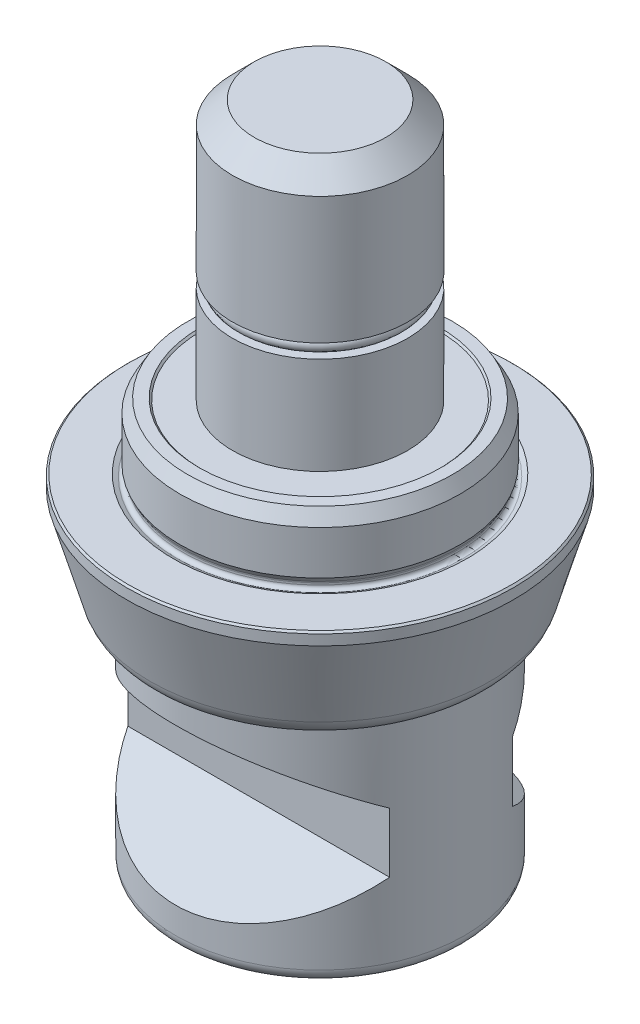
ISO-10303-21;
HEADER;
FILE_DESCRIPTION(('STEP AP214'),'2;1');
FILE_NAME('part.step','',(''),(''),'','','');
FILE_SCHEMA(('AUTOMOTIVE_DESIGN { 1 0 10303 214 1 1 1 1 }'));
ENDSEC;
DATA;
#1=APPLICATION_CONTEXT('core data for automotive mechanical design processes');
#2=APPLICATION_PROTOCOL_DEFINITION('international standard','automotive_design',2000,#1);
#3=PRODUCT_CONTEXT('',#1,'mechanical');
#4=PRODUCT('Part','Part','',(#3));
#5=PRODUCT_RELATED_PRODUCT_CATEGORY('part','',(#4));
#6=PRODUCT_DEFINITION_FORMATION('','',#4);
#7=PRODUCT_DEFINITION_CONTEXT('part definition',#1,'design');
#8=PRODUCT_DEFINITION('design','',#6,#7);
#9=PRODUCT_DEFINITION_SHAPE('','',#8);
#10=(LENGTH_UNIT() NAMED_UNIT(*) SI_UNIT(.MILLI.,.METRE.));
#11=(NAMED_UNIT(*) PLANE_ANGLE_UNIT() SI_UNIT($,.RADIAN.));
#12=(NAMED_UNIT(*) SI_UNIT($,.STERADIAN.) SOLID_ANGLE_UNIT());
#13=UNCERTAINTY_MEASURE_WITH_UNIT(LENGTH_MEASURE(1.E-05),#10,'distance_accuracy_value','');
#14=(GEOMETRIC_REPRESENTATION_CONTEXT(3) GLOBAL_UNCERTAINTY_ASSIGNED_CONTEXT((#13)) GLOBAL_UNIT_ASSIGNED_CONTEXT((#10,
#11,#12)) REPRESENTATION_CONTEXT('',''));
#15=CARTESIAN_POINT('',(0.,0.,0.));
#16=DIRECTION('',(0.,0.,1.));
#17=DIRECTION('',(1.,0.,0.));
#18=AXIS2_PLACEMENT_3D('',#15,#16,#17);
#19=CARTESIAN_POINT('',(0.,0.,0.));
#20=DIRECTION('',(0.,-1.,0.));
#21=DIRECTION('',(0.,0.,-1.));
#22=AXIS2_PLACEMENT_3D('',#19,#20,#21);
#23=CYLINDRICAL_SURFACE('',#22,16.);
#24=CARTESIAN_POINT('',(0.,1.,0.));
#25=DIRECTION('',(0.,-1.,0.));
#26=DIRECTION('',(0.,0.,-1.));
#27=AXIS2_PLACEMENT_3D('',#24,#25,#26);
#28=CIRCLE('',#27,16.);
#29=CARTESIAN_POINT('',(0.,1.,-16.));
#30=VERTEX_POINT('',#29);
#31=EDGE_CURVE('E378',#30,#30,#28,.T.);
#32=ORIENTED_EDGE('',*,*,#31,.F.);
#33=EDGE_LOOP('',(#32));
#34=FACE_BOUND('',#33,.T.);
#35=CARTESIAN_POINT('',(0.,6.,0.));
#36=DIRECTION('',(0.,1.,0.));
#37=DIRECTION('',(0.,0.,1.));
#38=AXIS2_PLACEMENT_3D('',#35,#36,#37);
#39=CIRCLE('',#38,16.);
#40=CARTESIAN_POINT('',(0.,6.,16.));
#41=VERTEX_POINT('',#40);
#42=EDGE_CURVE('E304',#41,#41,#39,.F.);
#43=ORIENTED_EDGE('',*,*,#42,.T.);
#44=EDGE_LOOP('',(#43));
#45=FACE_BOUND('',#44,.T.);
#46=ADVANCED_FACE('F16',(#34,#45),#23,.T.);
#47=CARTESIAN_POINT('',(16.,0.,0.));
#48=DIRECTION('',(0.,1.,0.));
#49=DIRECTION('',(0.,0.,1.));
#50=AXIS2_PLACEMENT_3D('',#47,#48,#49);
#51=PLANE('',#50);
#52=CARTESIAN_POINT('',(0.,0.,0.));
#53=DIRECTION('',(0.,-1.,0.));
#54=DIRECTION('',(0.,0.,-1.));
#55=AXIS2_PLACEMENT_3D('',#52,#53,#54);
#56=CIRCLE('',#55,16.774174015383);
#57=CARTESIAN_POINT('',(0.,0.,-16.774174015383));
#58=VERTEX_POINT('',#57);
#59=EDGE_CURVE('E375',#58,#58,#56,.T.);
#60=ORIENTED_EDGE('',*,*,#59,.T.);
#61=EDGE_LOOP('',(#60));
#62=FACE_BOUND('',#61,.T.);
#63=CARTESIAN_POINT('',(0.,0.,0.));
#64=DIRECTION('',(0.,1.,0.));
#65=DIRECTION('',(0.,0.,1.));
#66=AXIS2_PLACEMENT_3D('',#63,#64,#65);
#67=CIRCLE('',#66,21.9);
#68=CARTESIAN_POINT('',(0.,0.,21.9));
#69=VERTEX_POINT('',#68);
#70=EDGE_CURVE('E294',#69,#69,#67,.T.);
#71=ORIENTED_EDGE('',*,*,#70,.T.);
#72=EDGE_LOOP('',(#71));
#73=FACE_BOUND('',#72,.T.);
#74=ADVANCED_FACE('F257',(#62,#73),#51,.T.);
#75=CARTESIAN_POINT('',(0.,0.,0.));
#76=DIRECTION('',(0.,-1.,0.));
#77=DIRECTION('',(0.,0.,-1.));
#78=AXIS2_PLACEMENT_3D('',#75,#76,#77);
#79=CYLINDRICAL_SURFACE('',#78,22.1);
#80=CARTESIAN_POINT('',(0.,-0.199999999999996,0.));
#81=DIRECTION('',(0.,1.,0.));
#82=DIRECTION('',(0.,0.,1.));
#83=AXIS2_PLACEMENT_3D('',#80,#81,#82);
#84=CIRCLE('',#83,22.1);
#85=CARTESIAN_POINT('',(0.,-0.199999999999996,22.1));
#86=VERTEX_POINT('',#85);
#87=EDGE_CURVE('E297',#86,#86,#84,.F.);
#88=ORIENTED_EDGE('',*,*,#87,.T.);
#89=EDGE_LOOP('',(#88));
#90=FACE_BOUND('',#89,.T.);
#91=CARTESIAN_POINT('',(0.,-1.3949657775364,0.));
#92=DIRECTION('',(0.,-1.,0.));
#93=DIRECTION('',(0.,0.,-1.));
#94=AXIS2_PLACEMENT_3D('',#91,#92,#93);
#95=CIRCLE('',#94,22.1);
#96=CARTESIAN_POINT('',(0.,-1.3949657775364,-22.1));
#97=VERTEX_POINT('',#96);
#98=EDGE_CURVE('E369',#97,#97,#95,.T.);
#99=ORIENTED_EDGE('',*,*,#98,.F.);
#100=EDGE_LOOP('',(#99));
#101=FACE_BOUND('',#100,.T.);
#102=ADVANCED_FACE('F265',(#90,#101),#79,.T.);
#103=CARTESIAN_POINT('',(0.,-13.,0.));
#104=DIRECTION('',(0.,1.,0.));
#105=DIRECTION('',(0.,0.,1.));
#106=AXIS2_PLACEMENT_3D('',#103,#104,#105);
#107=CONICAL_SURFACE('',#106,18.7723099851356,0.279252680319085);
#108=CARTESIAN_POINT('',(0.,-10.826912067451,0.));
#109=DIRECTION('',(0.,-1.,0.));
#110=DIRECTION('',(0.,0.,-1.));
#111=AXIS2_PLACEMENT_3D('',#108,#109,#110);
#112=CIRCLE('',#111,19.3954329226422);
#113=CARTESIAN_POINT('',(0.,-10.826912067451,-19.3954329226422));
#114=VERTEX_POINT('',#113);
#115=EDGE_CURVE('E362',#114,#114,#112,.F.);
#116=ORIENTED_EDGE('',*,*,#115,.T.);
#117=EDGE_LOOP('',(#116));
#118=FACE_BOUND('',#117,.T.);
#119=ORIENTED_EDGE('',*,*,#98,.T.);
#120=EDGE_LOOP('',(#119));
#121=FACE_BOUND('',#120,.T.);
#122=ADVANCED_FACE('F409',(#118,#121),#107,.T.);
#123=CARTESIAN_POINT('',(10.,-13.,0.));
#124=DIRECTION('',(0.,-1.,0.));
#125=DIRECTION('',(0.,0.,-1.));
#126=AXIS2_PLACEMENT_3D('',#123,#124,#125);
#127=PLANE('',#126);
#128=CARTESIAN_POINT('',(0.,-13.,0.));
#129=DIRECTION('',(0.,-1.,0.));
#130=DIRECTION('',(0.,0.,-1.));
#131=AXIS2_PLACEMENT_3D('',#128,#129,#130);
#132=CIRCLE('',#131,16.);
#133=CARTESIAN_POINT('',(0.,-13.,-16.));
#134=VERTEX_POINT('',#133);
#135=EDGE_CURVE('E313',#134,#134,#132,.T.);
#136=ORIENTED_EDGE('',*,*,#135,.F.);
#137=EDGE_LOOP('',(#136));
#138=FACE_BOUND('',#137,.T.);
#139=CARTESIAN_POINT('',(0.,-13.,0.));
#140=DIRECTION('',(0.,-1.,0.));
#141=DIRECTION('',(0.,0.,-1.));
#142=AXIS2_PLACEMENT_3D('',#139,#140,#141);
#143=CIRCLE('',#142,16.5116478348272);
#144=CARTESIAN_POINT('',(0.,-13.,-16.5116478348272));
#145=VERTEX_POINT('',#144);
#146=EDGE_CURVE('E364',#145,#145,#143,.T.);
#147=ORIENTED_EDGE('',*,*,#146,.T.);
#148=EDGE_LOOP('',(#147));
#149=FACE_BOUND('',#148,.T.);
#150=ADVANCED_FACE('F356',(#138,#149),#127,.T.);
#151=CARTESIAN_POINT('',(10.,7.5,0.));
#152=DIRECTION('',(0.,1.,0.));
#153=DIRECTION('',(0.,0.,1.));
#154=AXIS2_PLACEMENT_3D('',#151,#152,#153);
#155=PLANE('',#154);
#156=CARTESIAN_POINT('',(0.,7.5,0.));
#157=DIRECTION('',(0.,1.,0.));
#158=DIRECTION('',(0.,0.,1.));
#159=AXIS2_PLACEMENT_3D('',#156,#157,#158);
#160=CIRCLE('',#159,13.8);
#161=CARTESIAN_POINT('',(0.,7.5,13.8));
#162=VERTEX_POINT('',#161);
#163=EDGE_CURVE('E310',#162,#162,#160,.F.);
#164=ORIENTED_EDGE('',*,*,#163,.T.);
#165=EDGE_LOOP('',(#164));
#166=FACE_BOUND('',#165,.T.);
#167=CARTESIAN_POINT('',(0.,7.5,0.));
#168=DIRECTION('',(0.,1.,0.));
#169=DIRECTION('',(0.,0.,1.));
#170=AXIS2_PLACEMENT_3D('',#167,#168,#169);
#171=CIRCLE('',#170,15.1339745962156);
#172=CARTESIAN_POINT('',(0.,7.5,15.1339745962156));
#173=VERTEX_POINT('',#172);
#174=EDGE_CURVE('E299',#173,#173,#171,.T.);
#175=ORIENTED_EDGE('',*,*,#174,.T.);
#176=EDGE_LOOP('',(#175));
#177=FACE_BOUND('',#176,.T.);
#178=ADVANCED_FACE('F276',(#166,#177),#155,.T.);
#179=CARTESIAN_POINT('',(0.,-10.,0.));
#180=DIRECTION('',(0.,-1.,0.));
#181=DIRECTION('',(0.,0.,-1.));
#182=AXIS2_PLACEMENT_3D('',#179,#180,#181);
#183=TOROIDAL_SURFACE('',#182,16.5116478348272,3.);
#184=ORIENTED_EDGE('',*,*,#115,.F.);
#185=EDGE_LOOP('',(#184));
#186=FACE_BOUND('',#185,.T.);
#187=ORIENTED_EDGE('',*,*,#146,.F.);
#188=EDGE_LOOP('',(#187));
#189=FACE_BOUND('',#188,.T.);
#190=ADVANCED_FACE('F272',(#186,#189),#183,.T.);
#191=CARTESIAN_POINT('',(0.,6.,0.));
#192=DIRECTION('',(0.,-1.,0.));
#193=DIRECTION('',(0.,0.,-1.));
#194=AXIS2_PLACEMENT_3D('',#191,#192,#193);
#195=CONICAL_SURFACE('',#194,16.,0.523598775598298);
#196=ORIENTED_EDGE('',*,*,#174,.F.);
#197=EDGE_LOOP('',(#196));
#198=FACE_BOUND('',#197,.T.);
#199=ORIENTED_EDGE('',*,*,#42,.F.);
#200=EDGE_LOOP('',(#199));
#201=FACE_BOUND('',#200,.T.);
#202=ADVANCED_FACE('F275',(#198,#201),#195,.T.);
#203=CARTESIAN_POINT('',(0.,-0.199999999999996,0.));
#204=DIRECTION('',(0.,-1.,0.));
#205=DIRECTION('',(0.,0.,-1.));
#206=AXIS2_PLACEMENT_3D('',#203,#204,#205);
#207=CONICAL_SURFACE('',#206,22.1,0.785398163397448);
#208=ORIENTED_EDGE('',*,*,#70,.F.);
#209=EDGE_LOOP('',(#208));
#210=FACE_BOUND('',#209,.T.);
#211=ORIENTED_EDGE('',*,*,#87,.F.);
#212=EDGE_LOOP('',(#211));
#213=FACE_BOUND('',#212,.T.);
#214=ADVANCED_FACE('F279',(#210,#213),#207,.T.);
#215=CARTESIAN_POINT('',(0.,0.1,0.));
#216=DIRECTION('',(0.,-1.,0.));
#217=DIRECTION('',(0.,0.,-1.));
#218=AXIS2_PLACEMENT_3D('',#215,#216,#217);
#219=TOROIDAL_SURFACE('',#218,16.1,0.4);
#220=CARTESIAN_POINT('',(0.,-0.254804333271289,0.));
#221=DIRECTION('',(0.,-1.,0.));
#222=DIRECTION('',(0.,0.,-1.));
#223=AXIS2_PLACEMENT_3D('',#220,#221,#222);
#224=CIRCLE('',#223,16.284699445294);
#225=CARTESIAN_POINT('',(0.,-0.254804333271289,-16.284699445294));
#226=VERTEX_POINT('',#225);
#227=EDGE_CURVE('E372',#226,#226,#224,.T.);
#228=ORIENTED_EDGE('',*,*,#227,.F.);
#229=EDGE_LOOP('',(#228));
#230=FACE_BOUND('',#229,.T.);
#231=CARTESIAN_POINT('',(0.,0.0999999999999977,0.));
#232=DIRECTION('',(0.,-1.,0.));
#233=DIRECTION('',(0.,0.,-1.));
#234=AXIS2_PLACEMENT_3D('',#231,#232,#233);
#235=CIRCLE('',#234,15.7);
#236=CARTESIAN_POINT('',(0.,0.0999999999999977,-15.7));
#237=VERTEX_POINT('',#236);
#238=EDGE_CURVE('E185',#237,#237,#235,.T.);
#239=ORIENTED_EDGE('',*,*,#238,.T.);
#240=EDGE_LOOP('',(#239));
#241=FACE_BOUND('',#240,.T.);
#242=ADVANCED_FACE('F282',(#230,#241),#219,.F.);
#243=CARTESIAN_POINT('',(0.,-0.254804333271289,0.));
#244=DIRECTION('',(0.,1.,0.));
#245=DIRECTION('',(0.,0.,1.));
#246=AXIS2_PLACEMENT_3D('',#243,#244,#245);
#247=CONICAL_SURFACE('',#246,16.284699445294,1.09083078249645);
#248=ORIENTED_EDGE('',*,*,#59,.F.);
#249=EDGE_LOOP('',(#248));
#250=FACE_BOUND('',#249,.T.);
#251=ORIENTED_EDGE('',*,*,#227,.T.);
#252=EDGE_LOOP('',(#251));
#253=FACE_BOUND('',#252,.T.);
#254=ADVANCED_FACE('F288',(#250,#253),#247,.F.);
#255=CARTESIAN_POINT('',(0.,1.,0.));
#256=DIRECTION('',(0.,1.,0.));
#257=DIRECTION('',(0.,0.,1.));
#258=AXIS2_PLACEMENT_3D('',#255,#256,#257);
#259=CONICAL_SURFACE('',#258,16.,0.47123889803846);
#260=CARTESIAN_POINT('',(0.,0.496781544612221,0.));
#261=DIRECTION('',(0.,-1.,0.));
#262=DIRECTION('',(0.,0.,-1.));
#263=AXIS2_PLACEMENT_3D('',#260,#261,#262);
#264=CIRCLE('',#263,15.7435973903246);
#265=CARTESIAN_POINT('',(0.,0.496781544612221,-15.7435973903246));
#266=VERTEX_POINT('',#265);
#267=EDGE_CURVE('E381',#266,#266,#264,.T.);
#268=ORIENTED_EDGE('',*,*,#267,.F.);
#269=EDGE_LOOP('',(#268));
#270=FACE_BOUND('',#269,.T.);
#271=ORIENTED_EDGE('',*,*,#31,.T.);
#272=EDGE_LOOP('',(#271));
#273=FACE_BOUND('',#272,.T.);
#274=ADVANCED_FACE('F393',(#270,#273),#259,.T.);
#275=CARTESIAN_POINT('',(0.,0.315185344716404,0.));
#276=DIRECTION('',(0.,-1.,0.));
#277=DIRECTION('',(0.,0.,-1.));
#278=AXIS2_PLACEMENT_3D('',#275,#276,#277);
#279=TOROIDAL_SURFACE('',#278,16.1,0.4);
#280=CARTESIAN_POINT('',(0.,0.315185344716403,0.));
#281=DIRECTION('',(0.,-1.,0.));
#282=DIRECTION('',(0.,0.,-1.));
#283=AXIS2_PLACEMENT_3D('',#280,#281,#282);
#284=CIRCLE('',#283,15.7);
#285=CARTESIAN_POINT('',(0.,0.315185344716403,-15.7));
#286=VERTEX_POINT('',#285);
#287=EDGE_CURVE('E383',#286,#286,#284,.T.);
#288=ORIENTED_EDGE('',*,*,#287,.F.);
#289=EDGE_LOOP('',(#288));
#290=FACE_BOUND('',#289,.T.);
#291=ORIENTED_EDGE('',*,*,#267,.T.);
#292=EDGE_LOOP('',(#291));
#293=FACE_BOUND('',#292,.T.);
#294=ADVANCED_FACE('F349',(#290,#293),#279,.F.);
#295=CARTESIAN_POINT('',(0.,0.,0.));
#296=DIRECTION('',(0.,-1.,0.));
#297=DIRECTION('',(0.,0.,-1.));
#298=AXIS2_PLACEMENT_3D('',#295,#296,#297);
#299=CYLINDRICAL_SURFACE('',#298,15.7);
#300=ORIENTED_EDGE('',*,*,#238,.F.);
#301=EDGE_LOOP('',(#300));
#302=FACE_BOUND('',#301,.T.);
#303=ORIENTED_EDGE('',*,*,#287,.T.);
#304=EDGE_LOOP('',(#303));
#305=FACE_BOUND('',#304,.T.);
#306=ADVANCED_FACE('F343',(#302,#305),#299,.T.);
#307=CARTESIAN_POINT('',(0.,7.3,0.));
#308=DIRECTION('',(0.,1.,0.));
#309=DIRECTION('',(0.,0.,1.));
#310=AXIS2_PLACEMENT_3D('',#307,#308,#309);
#311=CONICAL_SURFACE('',#310,13.6,0.785398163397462);
#312=ORIENTED_EDGE('',*,*,#163,.F.);
#313=EDGE_LOOP('',(#312));
#314=FACE_BOUND('',#313,.T.);
#315=CARTESIAN_POINT('',(0.,7.3,0.));
#316=DIRECTION('',(0.,1.,0.));
#317=DIRECTION('',(0.,0.,1.));
#318=AXIS2_PLACEMENT_3D('',#315,#316,#317);
#319=CIRCLE('',#318,13.6);
#320=CARTESIAN_POINT('',(0.,7.3,13.6));
#321=VERTEX_POINT('',#320);
#322=EDGE_CURVE('E301',#321,#321,#319,.T.);
#323=ORIENTED_EDGE('',*,*,#322,.F.);
#324=EDGE_LOOP('',(#323));
#325=FACE_BOUND('',#324,.T.);
#326=ADVANCED_FACE('F19',(#314,#325),#311,.F.);
#327=CARTESIAN_POINT('',(0.,7.3,0.));
#328=DIRECTION('',(0.,-1.,0.));
#329=DIRECTION('',(0.,0.,-1.));
#330=AXIS2_PLACEMENT_3D('',#327,#328,#329);
#331=PLANE('',#330);
#332=CARTESIAN_POINT('',(0.,7.3,0.));
#333=DIRECTION('',(0.,-1.,0.));
#334=DIRECTION('',(0.,0.,-1.));
#335=AXIS2_PLACEMENT_3D('',#332,#333,#334);
#336=CIRCLE('',#335,10.);
#337=CARTESIAN_POINT('',(0.,7.3,-10.));
#338=VERTEX_POINT('',#337);
#339=EDGE_CURVE('E101',#338,#338,#336,.T.);
#340=ORIENTED_EDGE('',*,*,#339,.T.);
#341=EDGE_LOOP('',(#340));
#342=FACE_BOUND('',#341,.T.);
#343=ORIENTED_EDGE('',*,*,#322,.T.);
#344=EDGE_LOOP('',(#343));
#345=FACE_BOUND('',#344,.T.);
#346=ADVANCED_FACE('F326',(#342,#345),#331,.F.);
#347=CARTESIAN_POINT('',(0.,18.4,10.));
#348=DIRECTION('',(0.,-1.,0.));
#349=DIRECTION('',(1.,0.,0.));
#350=AXIS2_PLACEMENT_3D('',#347,#348,#349);
#351=PLANE('',#350);
#352=CARTESIAN_POINT('',(0.,18.4,0.));
#353=DIRECTION('',(0.,-1.,0.));
#354=DIRECTION('',(0.,0.,-1.));
#355=AXIS2_PLACEMENT_3D('',#352,#353,#354);
#356=CIRCLE('',#355,8.75);
#357=CARTESIAN_POINT('',(0.,18.4,-8.75));
#358=VERTEX_POINT('',#357);
#359=EDGE_CURVE('E25',#358,#358,#356,.F.);
#360=ORIENTED_EDGE('',*,*,#359,.F.);
#361=EDGE_LOOP('',(#360));
#362=FACE_BOUND('',#361,.T.);
#363=CARTESIAN_POINT('',(0.,18.4,0.));
#364=DIRECTION('',(0.,-1.,0.));
#365=DIRECTION('',(1.,0.,0.));
#366=AXIS2_PLACEMENT_3D('',#363,#364,#365);
#367=CIRCLE('',#366,10.);
#368=CARTESIAN_POINT('',(10.,18.4,0.));
#369=VERTEX_POINT('',#368);
#370=EDGE_CURVE('E136',#369,#369,#367,.T.);
#371=ORIENTED_EDGE('',*,*,#370,.F.);
#372=EDGE_LOOP('',(#371));
#373=FACE_BOUND('',#372,.T.);
#374=ADVANCED_FACE('F322',(#362,#373),#351,.F.);
#375=CARTESIAN_POINT('',(0.,-13.,0.));
#376=DIRECTION('',(0.,-1.,0.));
#377=DIRECTION('',(1.,0.,0.));
#378=AXIS2_PLACEMENT_3D('',#375,#376,#377);
#379=CYLINDRICAL_SURFACE('',#378,10.);
#380=ORIENTED_EDGE('',*,*,#370,.T.);
#381=EDGE_LOOP('',(#380));
#382=FACE_BOUND('',#381,.T.);
#383=ORIENTED_EDGE('',*,*,#339,.F.);
#384=EDGE_LOOP('',(#383));
#385=FACE_BOUND('',#384,.T.);
#386=ADVANCED_FACE('F325',(#382,#385),#379,.T.);
#387=CARTESIAN_POINT('',(0.,-13.,0.));
#388=DIRECTION('',(0.,-1.,0.));
#389=DIRECTION('',(1.,0.,0.));
#390=AXIS2_PLACEMENT_3D('',#387,#388,#389);
#391=CYLINDRICAL_SURFACE('',#390,16.5);
#392=CARTESIAN_POINT('',(0.,-37.4,0.));
#393=DIRECTION('',(0.,-1.,0.));
#394=DIRECTION('',(1.,0.,0.));
#395=AXIS2_PLACEMENT_3D('',#392,#393,#394);
#396=CIRCLE('',#395,16.5);
#397=CARTESIAN_POINT('',(16.5,-37.4,0.));
#398=VERTEX_POINT('',#397);
#399=EDGE_CURVE('E102',#398,#398,#396,.F.);
#400=ORIENTED_EDGE('',*,*,#399,.T.);
#401=EDGE_LOOP('',(#400));
#402=FACE_BOUND('',#401,.T.);
#403=DIRECTION('',(0.,-1.,0.));
#404=VECTOR('',#403,1.);
#405=CARTESIAN_POINT('',(14.9415527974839,-13.,7.));
#406=LINE('',#405,#404);
#407=CARTESIAN_POINT('',(14.9415527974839,-28.9151724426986,7.));
#408=VERTEX_POINT('',#407);
#409=CARTESIAN_POINT('',(14.9415527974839,-22.0848275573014,7.));
#410=VERTEX_POINT('',#409);
#411=EDGE_CURVE('E161',#408,#410,#406,.F.);
#412=ORIENTED_EDGE('',*,*,#411,.F.);
#413=CARTESIAN_POINT('',(0.,-24.8737205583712,0.));
#414=DIRECTION('',(0.,-0.866025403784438,-0.5));
#415=DIRECTION('',(0.,-0.5,0.866025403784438));
#416=AXIS2_PLACEMENT_3D('',#413,#414,#415);
#417=ELLIPSE('',#416,19.0525588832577,16.5);
#418=CARTESIAN_POINT('',(-14.9415527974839,-28.9151724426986,7.));
#419=VERTEX_POINT('',#418);
#420=EDGE_CURVE('E157',#419,#408,#417,.F.);
#421=ORIENTED_EDGE('',*,*,#420,.F.);
#422=DIRECTION('',(0.,-1.,0.));
#423=VECTOR('',#422,1.);
#424=CARTESIAN_POINT('',(-14.9415527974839,-13.,7.));
#425=LINE('',#424,#423);
#426=CARTESIAN_POINT('',(-14.9415527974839,-22.0848275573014,7.));
#427=VERTEX_POINT('',#426);
#428=EDGE_CURVE('E155',#427,#419,#425,.T.);
#429=ORIENTED_EDGE('',*,*,#428,.F.);
#430=CARTESIAN_POINT('',(0.,-26.1262794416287,0.));
#431=DIRECTION('',(0.,0.866025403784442,-0.5));
#432=DIRECTION('',(0.,-0.5,-0.866025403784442));
#433=AXIS2_PLACEMENT_3D('',#430,#431,#432);
#434=ELLIPSE('',#433,19.0525588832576,16.5);
#435=EDGE_CURVE('E159',#410,#427,#434,.F.);
#436=ORIENTED_EDGE('',*,*,#435,.F.);
#437=EDGE_LOOP('',(#412,#421,#429,#436));
#438=FACE_BOUND('',#437,.T.);
#439=CARTESIAN_POINT('',(0.,-13.5,0.));
#440=DIRECTION('',(0.,1.,0.));
#441=DIRECTION('',(-1.,0.,0.));
#442=AXIS2_PLACEMENT_3D('',#439,#440,#441);
#443=CIRCLE('',#442,16.5);
#444=CARTESIAN_POINT('',(-16.5,-13.5,0.));
#445=VERTEX_POINT('',#444);
#446=EDGE_CURVE('E152',#445,#445,#443,.F.);
#447=ORIENTED_EDGE('',*,*,#446,.T.);
#448=EDGE_LOOP('',(#447));
#449=FACE_BOUND('',#448,.T.);
#450=CARTESIAN_POINT('',(0.,-24.8737205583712,0.));
#451=DIRECTION('',(0.,0.866025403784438,-0.5));
#452=DIRECTION('',(0.,-0.5,-0.866025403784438));
#453=AXIS2_PLACEMENT_3D('',#450,#451,#452);
#454=ELLIPSE('',#453,19.0525588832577,16.5);
#455=CARTESIAN_POINT('',(-14.9415527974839,-28.9151724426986,-7.));
#456=VERTEX_POINT('',#455);
#457=CARTESIAN_POINT('',(14.9415527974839,-28.9151724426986,-7.));
#458=VERTEX_POINT('',#457);
#459=EDGE_CURVE('E163',#456,#458,#454,.F.);
#460=ORIENTED_EDGE('',*,*,#459,.T.);
#461=DIRECTION('',(0.,-1.,0.));
#462=VECTOR('',#461,1.);
#463=CARTESIAN_POINT('',(14.9415527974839,-13.,-7.));
#464=LINE('',#463,#462);
#465=CARTESIAN_POINT('',(14.9415527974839,-22.0848275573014,-7.));
#466=VERTEX_POINT('',#465);
#467=EDGE_CURVE('E171',#458,#466,#464,.F.);
#468=ORIENTED_EDGE('',*,*,#467,.T.);
#469=CARTESIAN_POINT('',(0.,-26.1262794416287,0.));
#470=DIRECTION('',(0.,-0.866025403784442,-0.5));
#471=DIRECTION('',(0.,-0.5,0.866025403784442));
#472=AXIS2_PLACEMENT_3D('',#469,#470,#471);
#473=ELLIPSE('',#472,19.0525588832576,16.5);
#474=CARTESIAN_POINT('',(-14.9415527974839,-22.0848275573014,-7.));
#475=VERTEX_POINT('',#474);
#476=EDGE_CURVE('E168',#466,#475,#473,.F.);
#477=ORIENTED_EDGE('',*,*,#476,.T.);
#478=DIRECTION('',(0.,-1.,0.));
#479=VECTOR('',#478,1.);
#480=CARTESIAN_POINT('',(-14.9415527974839,-13.,-7.));
#481=LINE('',#480,#479);
#482=EDGE_CURVE('E165',#475,#456,#481,.T.);
#483=ORIENTED_EDGE('',*,*,#482,.T.);
#484=EDGE_LOOP('',(#460,#468,#477,#483));
#485=FACE_BOUND('',#484,.T.);
#486=ADVANCED_FACE('F332',(#402,#438,#449,#485),#391,.T.);
#487=CARTESIAN_POINT('',(0.,-38.9,16.5));
#488=DIRECTION('',(0.,-1.,0.));
#489=DIRECTION('',(1.,0.,0.));
#490=AXIS2_PLACEMENT_3D('',#487,#488,#489);
#491=PLANE('',#490);
#492=CARTESIAN_POINT('',(0.,-38.9,0.));
#493=DIRECTION('',(0.,1.,0.));
#494=DIRECTION('',(-1.,0.,0.));
#495=AXIS2_PLACEMENT_3D('',#492,#493,#494);
#496=CIRCLE('',#495,5.);
#497=CARTESIAN_POINT('',(-5.,-38.9,0.));
#498=VERTEX_POINT('',#497);
#499=EDGE_CURVE('E588',#498,#498,#496,.T.);
#500=ORIENTED_EDGE('',*,*,#499,.T.);
#501=EDGE_LOOP('',(#500));
#502=FACE_BOUND('',#501,.T.);
#503=CARTESIAN_POINT('',(0.,-38.9,0.));
#504=DIRECTION('',(0.,-1.,0.));
#505=DIRECTION('',(1.,0.,0.));
#506=AXIS2_PLACEMENT_3D('',#503,#504,#505);
#507=CIRCLE('',#506,15.);
#508=CARTESIAN_POINT('',(15.,-38.9,0.));
#509=VERTEX_POINT('',#508);
#510=EDGE_CURVE('E174',#509,#509,#507,.T.);
#511=ORIENTED_EDGE('',*,*,#510,.T.);
#512=EDGE_LOOP('',(#511));
#513=FACE_BOUND('',#512,.T.);
#514=ADVANCED_FACE('F488',(#502,#513),#491,.T.);
#515=CARTESIAN_POINT('',(0.,-13.5,0.));
#516=DIRECTION('',(0.,-1.,0.));
#517=DIRECTION('',(1.,0.,0.));
#518=AXIS2_PLACEMENT_3D('',#515,#516,#517);
#519=CONICAL_SURFACE('',#518,16.5,0.785398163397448);
#520=ORIENTED_EDGE('',*,*,#135,.T.);
#521=EDGE_LOOP('',(#520));
#522=FACE_BOUND('',#521,.T.);
#523=ORIENTED_EDGE('',*,*,#446,.F.);
#524=EDGE_LOOP('',(#523));
#525=FACE_BOUND('',#524,.T.);
#526=ADVANCED_FACE('F496',(#522,#525),#519,.T.);
#527=CARTESIAN_POINT('',(20.,-16.6,16.5));
#528=DIRECTION('',(0.,0.866025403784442,-0.5));
#529=DIRECTION('',(0.,-0.5,-0.866025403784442));
#530=AXIS2_PLACEMENT_3D('',#527,#528,#529);
#531=PLANE('',#530);
#532=DIRECTION('',(-1.,0.,0.));
#533=VECTOR('',#532,1.);
#534=CARTESIAN_POINT('',(20.,-22.0848275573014,7.));
#535=LINE('',#534,#533);
#536=EDGE_CURVE('E40',#410,#427,#535,.T.);
#537=ORIENTED_EDGE('',*,*,#536,.F.);
#538=ORIENTED_EDGE('',*,*,#435,.T.);
#539=EDGE_LOOP('',(#537,#538));
#540=FACE_BOUND('',#539,.T.);
#541=ADVANCED_FACE('F504',(#540),#531,.F.);
#542=CARTESIAN_POINT('',(20.,-28.9151724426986,7.));
#543=DIRECTION('',(0.,-0.866025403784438,-0.5));
#544=DIRECTION('',(0.,-0.5,0.866025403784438));
#545=AXIS2_PLACEMENT_3D('',#542,#543,#544);
#546=PLANE('',#545);
#547=ORIENTED_EDGE('',*,*,#420,.T.);
#548=DIRECTION('',(-1.,0.,0.));
#549=VECTOR('',#548,1.);
#550=CARTESIAN_POINT('',(20.,-28.9151724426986,7.));
#551=LINE('',#550,#549);
#552=EDGE_CURVE('E133',#408,#419,#551,.T.);
#553=ORIENTED_EDGE('',*,*,#552,.T.);
#554=EDGE_LOOP('',(#547,#553));
#555=FACE_BOUND('',#554,.T.);
#556=ADVANCED_FACE('F512',(#555),#546,.F.);
#557=CARTESIAN_POINT('',(20.,-22.0848275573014,7.));
#558=DIRECTION('',(0.,0.,-1.));
#559=DIRECTION('',(-1.,0.,0.));
#560=AXIS2_PLACEMENT_3D('',#557,#558,#559);
#561=PLANE('',#560);
#562=ORIENTED_EDGE('',*,*,#411,.T.);
#563=ORIENTED_EDGE('',*,*,#536,.T.);
#564=ORIENTED_EDGE('',*,*,#428,.T.);
#565=ORIENTED_EDGE('',*,*,#552,.F.);
#566=EDGE_LOOP('',(#562,#563,#564,#565));
#567=FACE_BOUND('',#566,.T.);
#568=ADVANCED_FACE('F520',(#567),#561,.F.);
#569=CARTESIAN_POINT('',(20.,-16.6,-16.5));
#570=DIRECTION('',(0.,-0.866025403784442,-0.5));
#571=DIRECTION('',(0.,-0.5,0.866025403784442));
#572=AXIS2_PLACEMENT_3D('',#569,#570,#571);
#573=PLANE('',#572);
#574=DIRECTION('',(-1.,0.,0.));
#575=VECTOR('',#574,1.);
#576=CARTESIAN_POINT('',(20.,-22.0848275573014,-7.));
#577=LINE('',#576,#575);
#578=EDGE_CURVE('E127',#466,#475,#577,.T.);
#579=ORIENTED_EDGE('',*,*,#578,.T.);
#580=ORIENTED_EDGE('',*,*,#476,.F.);
#581=EDGE_LOOP('',(#579,#580));
#582=FACE_BOUND('',#581,.T.);
#583=ADVANCED_FACE('F528',(#582),#573,.T.);
#584=CARTESIAN_POINT('',(20.,-22.0848275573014,-7.));
#585=DIRECTION('',(0.,0.,-1.));
#586=DIRECTION('',(-1.,0.,0.));
#587=AXIS2_PLACEMENT_3D('',#584,#585,#586);
#588=PLANE('',#587);
#589=DIRECTION('',(-1.,0.,0.));
#590=VECTOR('',#589,1.);
#591=CARTESIAN_POINT('',(20.,-28.9151724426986,-7.));
#592=LINE('',#591,#590);
#593=EDGE_CURVE('E130',#458,#456,#592,.T.);
#594=ORIENTED_EDGE('',*,*,#593,.T.);
#595=ORIENTED_EDGE('',*,*,#482,.F.);
#596=ORIENTED_EDGE('',*,*,#578,.F.);
#597=ORIENTED_EDGE('',*,*,#467,.F.);
#598=EDGE_LOOP('',(#594,#595,#596,#597));
#599=FACE_BOUND('',#598,.T.);
#600=ADVANCED_FACE('F535',(#599),#588,.T.);
#601=CARTESIAN_POINT('',(20.,-28.9151724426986,-7.));
#602=DIRECTION('',(0.,0.866025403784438,-0.5));
#603=DIRECTION('',(0.,-0.5,-0.866025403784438));
#604=AXIS2_PLACEMENT_3D('',#601,#602,#603);
#605=PLANE('',#604);
#606=ORIENTED_EDGE('',*,*,#459,.F.);
#607=ORIENTED_EDGE('',*,*,#593,.F.);
#608=EDGE_LOOP('',(#606,#607));
#609=FACE_BOUND('',#608,.T.);
#610=ADVANCED_FACE('F543',(#609),#605,.T.);
#611=CARTESIAN_POINT('',(0.,-37.4,0.));
#612=DIRECTION('',(0.,-1.,0.));
#613=DIRECTION('',(1.,0.,0.));
#614=AXIS2_PLACEMENT_3D('',#611,#612,#613);
#615=TOROIDAL_SURFACE('',#614,15.,1.5);
#616=ORIENTED_EDGE('',*,*,#399,.F.);
#617=EDGE_LOOP('',(#616));
#618=FACE_BOUND('',#617,.T.);
#619=ORIENTED_EDGE('',*,*,#510,.F.);
#620=EDGE_LOOP('',(#619));
#621=FACE_BOUND('',#620,.T.);
#622=ADVANCED_FACE('F195',(#618,#621),#615,.T.);
#623=CARTESIAN_POINT('',(0.,-38.9,0.));
#624=DIRECTION('',(0.,-1.,0.));
#625=DIRECTION('',(1.,0.,0.));
#626=AXIS2_PLACEMENT_3D('',#623,#624,#625);
#627=CONICAL_SURFACE('',#626,5.,1.0471975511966);
#628=ORIENTED_EDGE('',*,*,#499,.F.);
#629=EDGE_LOOP('',(#628));
#630=FACE_BOUND('',#629,.T.);
#631=CARTESIAN_POINT('',(-0.000199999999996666,-38.6799819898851,4.61891762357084));
#632=CARTESIAN_POINT('',(0.175579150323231,-38.6213676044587,4.5174314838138));
#633=CARTESIAN_POINT('',(0.352875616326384,-38.5680600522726,4.41506932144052));
#634=CARTESIAN_POINT('',(0.71053859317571,-38.4750114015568,4.20857250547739));
#635=CARTESIAN_POINT('',(0.890911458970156,-38.4353032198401,4.10443418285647));
#636=CARTESIAN_POINT('',(1.2494218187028,-38.3734919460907,3.89744813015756));
#637=CARTESIAN_POINT('',(1.42750415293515,-38.3509774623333,3.79463224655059));
#638=CARTESIAN_POINT('',(1.78450671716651,-38.324100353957,3.58851671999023));
#639=CARTESIAN_POINT('',(1.96342564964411,-38.3197154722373,3.48521782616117));
#640=CARTESIAN_POINT('',(2.29774284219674,-38.3288398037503,3.29219970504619));
#641=CARTESIAN_POINT('',(2.45319115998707,-38.3401086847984,3.20245157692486));
#642=CARTESIAN_POINT('',(2.76307505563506,-38.3758237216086,3.02354002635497));
#643=CARTESIAN_POINT('',(2.91750956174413,-38.4002820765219,2.93437722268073));
#644=CARTESIAN_POINT('',(3.22803232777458,-38.4614257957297,2.75509682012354));
#645=CARTESIAN_POINT('',(3.3840812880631,-38.4983703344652,2.6650019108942));
#646=CARTESIAN_POINT('',(3.69385183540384,-38.5822198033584,2.48615580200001));
#647=CARTESIAN_POINT('',(3.84757739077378,-38.6291050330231,2.39740231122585));
#648=CARTESIAN_POINT('',(4.0002,-38.6799819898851,2.30928560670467));
#649=B_SPLINE_CURVE_WITH_KNOTS('',3,(#631,#632,#633,#634,#635,#636,#637,#638,#639,#640,#641,
#642,#643,#644,#645,#646,#647,#648),.UNSPECIFIED.,.F.,.F.,(4,2,2,2,2,2,2,2,4),(0.,
0.634047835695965,1.26961969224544,1.88946157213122,2.50854226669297,3.04757825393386,
3.58711366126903,4.13861653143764,4.68903648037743),.UNSPECIFIED.);
#650=CARTESIAN_POINT('',(0.,-38.6799153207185,4.618802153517));
#651=VERTEX_POINT('',#650);
#652=CARTESIAN_POINT('',(4.,-38.6799153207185,2.30940107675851));
#653=VERTEX_POINT('',#652);
#654=EDGE_CURVE('E95',#651,#653,#649,.T.);
#655=ORIENTED_EDGE('',*,*,#654,.T.);
#656=CARTESIAN_POINT('',(4.,-41.0517797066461,7.75631262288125));
#657=CARTESIAN_POINT('',(4.,-40.9588271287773,7.57514094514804));
#658=CARTESIAN_POINT('',(4.,-40.8663960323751,7.39369931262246));
#659=CARTESIAN_POINT('',(4.,-40.6828377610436,7.03015351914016));
#660=CARTESIAN_POINT('',(4.,-40.5917106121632,6.84804934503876));
#661=CARTESIAN_POINT('',(4.,-40.4108738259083,6.48275784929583));
#662=CARTESIAN_POINT('',(4.,-40.3211668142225,6.29956922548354));
#663=CARTESIAN_POINT('',(4.,-40.1436851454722,5.93225352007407));
#664=CARTESIAN_POINT('',(4.,-40.0559105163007,5.74812642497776));
#665=CARTESIAN_POINT('',(4.,-39.8782736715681,5.36918294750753));
#666=CARTESIAN_POINT('',(4.,-39.7885386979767,5.17430674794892));
#667=CARTESIAN_POINT('',(4.,-39.6124381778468,4.78304464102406));
#668=CARTESIAN_POINT('',(4.,-39.5260724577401,4.58665881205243));
#669=CARTESIAN_POINT('',(4.,-39.3577259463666,4.19216428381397));
#670=CARTESIAN_POINT('',(4.,-39.2757422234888,3.99405684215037));
#671=CARTESIAN_POINT('',(4.,-39.1173873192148,3.59554249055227));
#672=CARTESIAN_POINT('',(4.,-39.0410174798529,3.39513504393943));
#673=CARTESIAN_POINT('',(4.,-38.8833087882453,2.9573369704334));
#674=CARTESIAN_POINT('',(4.,-38.803331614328,2.71944997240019));
#675=CARTESIAN_POINT('',(4.,-38.6573348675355,2.23943941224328));
#676=CARTESIAN_POINT('',(4.,-38.5913080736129,1.99731811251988));
#677=CARTESIAN_POINT('',(4.,-38.5069180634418,1.6331545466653));
#678=CARTESIAN_POINT('',(4.,-38.4814067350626,1.51276218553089));
#679=CARTESIAN_POINT('',(4.,-38.4355332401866,1.27099219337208));
#680=CARTESIAN_POINT('',(4.,-38.4151709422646,1.14961458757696));
#681=CARTESIAN_POINT('',(4.,-38.3801799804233,0.906083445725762));
#682=CARTESIAN_POINT('',(4.,-38.3655487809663,0.783930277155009));
#683=CARTESIAN_POINT('',(4.,-38.342481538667,0.539041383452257));
#684=CARTESIAN_POINT('',(4.,-38.334045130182,0.416305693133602));
#685=CARTESIAN_POINT('',(4.,-38.3235999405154,0.169007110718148));
#686=CARTESIAN_POINT('',(4.,-38.3216735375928,0.0444406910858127));
#687=CARTESIAN_POINT('',(4.,-38.3245515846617,-0.204613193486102));
#688=CARTESIAN_POINT('',(4.,-38.3293560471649,-0.329100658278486));
#689=CARTESIAN_POINT('',(4.,-38.3455188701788,-0.577675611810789));
#690=CARTESIAN_POINT('',(4.,-38.3568787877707,-0.701762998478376));
#691=CARTESIAN_POINT('',(4.,-38.3857527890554,-0.949226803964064));
#692=CARTESIAN_POINT('',(4.,-38.4032678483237,-1.07260310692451));
#693=CARTESIAN_POINT('',(4.,-38.4650360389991,-1.44616252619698));
#694=CARTESIAN_POINT('',(4.,-38.5181610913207,-1.69489636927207));
#695=CARTESIAN_POINT('',(4.,-38.6423652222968,-2.18772666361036));
#696=CARTESIAN_POINT('',(4.,-38.7134490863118,-2.43182186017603));
#697=CARTESIAN_POINT('',(4.,-38.8639633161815,-2.90091972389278));
#698=CARTESIAN_POINT('',(4.,-38.9426157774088,-3.12617606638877));
#699=CARTESIAN_POINT('',(4.,-39.1084502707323,-3.573546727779));
#700=CARTESIAN_POINT('',(4.,-39.1956341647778,-3.79566034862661));
#701=CARTESIAN_POINT('',(4.,-39.3763941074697,-4.23751628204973));
#702=CARTESIAN_POINT('',(4.,-39.4699765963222,-4.45725593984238));
#703=CARTESIAN_POINT('',(4.,-39.6618648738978,-4.89462873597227));
#704=CARTESIAN_POINT('',(4.,-39.7601702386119,-5.11226206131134));
#705=CARTESIAN_POINT('',(4.,-39.9548904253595,-5.53396134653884));
#706=CARTESIAN_POINT('',(4.,-40.0511129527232,-5.73811644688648));
#707=CARTESIAN_POINT('',(4.,-40.246089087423,-6.14521937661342));
#708=CARTESIAN_POINT('',(4.,-40.3448427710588,-6.34816716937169));
#709=CARTESIAN_POINT('',(4.,-40.5440508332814,-6.75245129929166));
#710=CARTESIAN_POINT('',(4.,-40.6444990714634,-6.95379066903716));
#711=CARTESIAN_POINT('',(4.,-40.847014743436,-7.35563323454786));
#712=CARTESIAN_POINT('',(4.,-40.9490820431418,-7.5561364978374));
#713=CARTESIAN_POINT('',(4.,-41.0517797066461,-7.75631262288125));
#714=B_SPLINE_CURVE_WITH_KNOTS('',3,(#656,#657,#658,#659,#660,#661,#662,#663,#664,#665,#666,
#667,#668,#669,#670,#671,#672,#673,#674,#675,#676,#677,#678,#679,#680,#681,#682,#683,#684,#685,
#686,#687,#688,#689,#690,#691,#692,#693,#694,#695,#696,#697,#698,#699,#700,#701,#702,#703,#704,
#705,#706,#707,#708,#709,#710,#711,#712,#713),.UNSPECIFIED.,.F.,.F.,(4,2,2,2,2,2,2,2,2,2,2,2,2,
2,2,2,2,2,2,2,2,2,2,2,2,2,2,2,4),(0.,0.610878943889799,1.22177007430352,1.83368291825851,
2.44560458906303,3.08921144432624,3.73278510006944,4.37592266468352,5.0192134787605,
5.77184296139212,6.52408190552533,6.8931867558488,7.26228218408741,7.63121413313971,
8.00012430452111,8.37368556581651,8.74724752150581,9.12089824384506,9.4946082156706,
10.2566439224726,11.0188828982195,11.7344344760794,12.4501425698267,13.1665819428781,
13.8829571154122,14.5600200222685,15.2371033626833,15.9121114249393,16.5870638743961),.UNSPECIFIED.);
#715=CARTESIAN_POINT('',(4.,-38.6799153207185,-2.30940107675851));
#716=VERTEX_POINT('',#715);
#717=EDGE_CURVE('E114',#653,#716,#714,.T.);
#718=ORIENTED_EDGE('',*,*,#717,.T.);
#719=CARTESIAN_POINT('',(4.0002,-38.6799819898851,-2.30928560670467));
#720=CARTESIAN_POINT('',(3.82442084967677,-38.6213676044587,-2.41077174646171));
#721=CARTESIAN_POINT('',(3.64712438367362,-38.5680600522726,-2.513133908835));
#722=CARTESIAN_POINT('',(3.28946140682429,-38.4750114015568,-2.71963072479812));
#723=CARTESIAN_POINT('',(3.10908854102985,-38.4353032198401,-2.82376904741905));
#724=CARTESIAN_POINT('',(2.75057818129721,-38.3734919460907,-3.03075510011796));
#725=CARTESIAN_POINT('',(2.57249584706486,-38.3509774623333,-3.13357098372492));
#726=CARTESIAN_POINT('',(2.21549328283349,-38.324100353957,-3.33968651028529));
#727=CARTESIAN_POINT('',(2.03657435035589,-38.3197154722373,-3.44298540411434));
#728=CARTESIAN_POINT('',(1.70225715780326,-38.3288398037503,-3.63600352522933));
#729=CARTESIAN_POINT('',(1.54680884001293,-38.3401086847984,-3.72575165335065));
#730=CARTESIAN_POINT('',(1.23692494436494,-38.3758237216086,-3.90466320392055));
#731=CARTESIAN_POINT('',(1.08249043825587,-38.4002820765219,-3.99382600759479));
#732=CARTESIAN_POINT('',(0.77196767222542,-38.4614257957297,-4.17310641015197));
#733=CARTESIAN_POINT('',(0.615918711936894,-38.4983703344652,-4.26320131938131));
#734=CARTESIAN_POINT('',(0.306148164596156,-38.5822198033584,-4.44204742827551));
#735=CARTESIAN_POINT('',(0.152422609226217,-38.6291050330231,-4.53080091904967));
#736=CARTESIAN_POINT('',(-0.000200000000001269,-38.6799819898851,-4.61891762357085));
#737=B_SPLINE_CURVE_WITH_KNOTS('',3,(#719,#720,#721,#722,#723,#724,#725,#726,#727,#728,#729,
#730,#731,#732,#733,#734,#735,#736),.UNSPECIFIED.,.F.,.F.,(4,2,2,2,2,2,2,2,4),(0.,
0.634047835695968,1.26961969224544,1.88946157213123,2.50854226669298,3.04757825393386,
3.58711366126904,4.13861653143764,4.68903648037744),.UNSPECIFIED.);
#738=CARTESIAN_POINT('',(0.,-38.6799153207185,-4.61880215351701));
#739=VERTEX_POINT('',#738);
#740=EDGE_CURVE('E219',#716,#739,#737,.T.);
#741=ORIENTED_EDGE('',*,*,#740,.T.);
#742=CARTESIAN_POINT('',(0.000199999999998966,-38.6799819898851,-4.61891762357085));
#743=CARTESIAN_POINT('',(-0.175579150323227,-38.6213676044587,-4.51743148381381));
#744=CARTESIAN_POINT('',(-0.352875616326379,-38.5680600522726,-4.41506932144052));
#745=CARTESIAN_POINT('',(-0.710538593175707,-38.4750114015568,-4.2085725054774));
#746=CARTESIAN_POINT('',(-0.890911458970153,-38.4353032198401,-4.10443418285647));
#747=CARTESIAN_POINT('',(-1.24942181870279,-38.3734919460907,-3.89744813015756));
#748=CARTESIAN_POINT('',(-1.42750415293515,-38.3509774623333,-3.79463224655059));
#749=CARTESIAN_POINT('',(-1.78450671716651,-38.324100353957,-3.58851671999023));
#750=CARTESIAN_POINT('',(-1.9634256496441,-38.3197154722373,-3.48521782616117));
#751=CARTESIAN_POINT('',(-2.29774284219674,-38.3288398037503,-3.29219970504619));
#752=CARTESIAN_POINT('',(-2.45319115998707,-38.3401086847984,-3.20245157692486));
#753=CARTESIAN_POINT('',(-2.76307505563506,-38.3758237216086,-3.02354002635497));
#754=CARTESIAN_POINT('',(-2.91750956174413,-38.4002820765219,-2.93437722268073));
#755=CARTESIAN_POINT('',(-3.22803232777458,-38.4614257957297,-2.75509682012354));
#756=CARTESIAN_POINT('',(-3.3840812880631,-38.4983703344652,-2.6650019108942));
#757=CARTESIAN_POINT('',(-3.69385183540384,-38.5822198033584,-2.48615580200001));
#758=CARTESIAN_POINT('',(-3.84757739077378,-38.6291050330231,-2.39740231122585));
#759=CARTESIAN_POINT('',(-4.0002,-38.6799819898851,-2.30928560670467));
#760=B_SPLINE_CURVE_WITH_KNOTS('',3,(#742,#743,#744,#745,#746,#747,#748,#749,#750,#751,#752,
#753,#754,#755,#756,#757,#758,#759),.UNSPECIFIED.,.F.,.F.,(4,2,2,2,2,2,2,2,4),(0.,
0.634047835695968,1.26961969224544,1.88946157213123,2.50854226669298,3.04757825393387,
3.58711366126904,4.13861653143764,4.68903648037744),.UNSPECIFIED.);
#761=CARTESIAN_POINT('',(-4.,-38.6799153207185,-2.30940107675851));
#762=VERTEX_POINT('',#761);
#763=EDGE_CURVE('E212',#739,#762,#760,.T.);
#764=ORIENTED_EDGE('',*,*,#763,.T.);
#765=CARTESIAN_POINT('',(-4.,-41.0517797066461,-7.75631262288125));
#766=CARTESIAN_POINT('',(-4.,-40.9588271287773,-7.57514094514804));
#767=CARTESIAN_POINT('',(-4.,-40.8663960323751,-7.39369931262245));
#768=CARTESIAN_POINT('',(-4.,-40.6828377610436,-7.03015351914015));
#769=CARTESIAN_POINT('',(-4.,-40.5917106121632,-6.84804934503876));
#770=CARTESIAN_POINT('',(-4.,-40.4108738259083,-6.48275784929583));
#771=CARTESIAN_POINT('',(-4.,-40.3211668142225,-6.29956922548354));
#772=CARTESIAN_POINT('',(-4.,-40.1436851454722,-5.93225352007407));
#773=CARTESIAN_POINT('',(-4.,-40.0559105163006,-5.74812642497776));
#774=CARTESIAN_POINT('',(-4.,-39.8782736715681,-5.36918294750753));
#775=CARTESIAN_POINT('',(-4.,-39.7885386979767,-5.17430674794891));
#776=CARTESIAN_POINT('',(-4.,-39.6124381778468,-4.78304464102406));
#777=CARTESIAN_POINT('',(-4.,-39.5260724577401,-4.58665881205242));
#778=CARTESIAN_POINT('',(-4.,-39.3577259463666,-4.19216428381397));
#779=CARTESIAN_POINT('',(-4.,-39.2757422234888,-3.99405684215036));
#780=CARTESIAN_POINT('',(-4.,-39.1173873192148,-3.59554249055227));
#781=CARTESIAN_POINT('',(-4.,-39.0410174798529,-3.39513504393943));
#782=CARTESIAN_POINT('',(-4.,-38.8833087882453,-2.9573369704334));
#783=CARTESIAN_POINT('',(-4.,-38.803331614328,-2.71944997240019));
#784=CARTESIAN_POINT('',(-4.,-38.6573348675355,-2.23943941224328));
#785=CARTESIAN_POINT('',(-4.,-38.5913080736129,-1.99731811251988));
#786=CARTESIAN_POINT('',(-4.,-38.5069180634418,-1.6331545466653));
#787=CARTESIAN_POINT('',(-4.,-38.4814067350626,-1.51276218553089));
#788=CARTESIAN_POINT('',(-4.,-38.4355332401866,-1.27099219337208));
#789=CARTESIAN_POINT('',(-4.,-38.4151709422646,-1.14961458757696));
#790=CARTESIAN_POINT('',(-4.,-38.3801799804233,-0.906083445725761));
#791=CARTESIAN_POINT('',(-4.,-38.3655487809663,-0.783930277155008));
#792=CARTESIAN_POINT('',(-4.,-38.342481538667,-0.539041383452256));
#793=CARTESIAN_POINT('',(-4.,-38.334045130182,-0.416305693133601));
#794=CARTESIAN_POINT('',(-4.,-38.3235999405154,-0.169007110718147));
#795=CARTESIAN_POINT('',(-4.,-38.3216735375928,-0.0444406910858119));
#796=CARTESIAN_POINT('',(-4.,-38.3245515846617,0.204613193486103));
#797=CARTESIAN_POINT('',(-4.,-38.3293560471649,0.329100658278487));
#798=CARTESIAN_POINT('',(-4.,-38.3455188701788,0.57767561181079));
#799=CARTESIAN_POINT('',(-4.,-38.3568787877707,0.701762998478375));
#800=CARTESIAN_POINT('',(-4.,-38.3857527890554,0.949226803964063));
#801=CARTESIAN_POINT('',(-4.,-38.4032678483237,1.07260310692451));
#802=CARTESIAN_POINT('',(-4.,-38.4650360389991,1.44616252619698));
#803=CARTESIAN_POINT('',(-4.,-38.5181610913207,1.69489636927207));
#804=CARTESIAN_POINT('',(-4.,-38.6423652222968,2.18772666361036));
#805=CARTESIAN_POINT('',(-4.,-38.7134490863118,2.43182186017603));
#806=CARTESIAN_POINT('',(-4.,-38.8639633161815,2.90091972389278));
#807=CARTESIAN_POINT('',(-4.,-38.9426157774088,3.12617606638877));
#808=CARTESIAN_POINT('',(-4.,-39.1084502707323,3.573546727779));
#809=CARTESIAN_POINT('',(-4.,-39.1956341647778,3.79566034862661));
#810=CARTESIAN_POINT('',(-4.,-39.3763941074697,4.23751628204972));
#811=CARTESIAN_POINT('',(-4.,-39.4699765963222,4.45725593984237));
#812=CARTESIAN_POINT('',(-4.,-39.6618648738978,4.89462873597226));
#813=CARTESIAN_POINT('',(-4.,-39.7601702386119,5.11226206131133));
#814=CARTESIAN_POINT('',(-4.,-39.9548904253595,5.53396134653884));
#815=CARTESIAN_POINT('',(-4.,-40.0511129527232,5.73811644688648));
#816=CARTESIAN_POINT('',(-4.,-40.246089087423,6.14521937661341));
#817=CARTESIAN_POINT('',(-4.,-40.3448427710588,6.34816716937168));
#818=CARTESIAN_POINT('',(-4.,-40.5440508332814,6.75245129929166));
#819=CARTESIAN_POINT('',(-4.,-40.6444990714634,6.95379066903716));
#820=CARTESIAN_POINT('',(-4.,-40.847014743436,7.35563323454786));
#821=CARTESIAN_POINT('',(-4.,-40.9490820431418,7.5561364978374));
#822=CARTESIAN_POINT('',(-4.,-41.0517797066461,7.75631262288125));
#823=B_SPLINE_CURVE_WITH_KNOTS('',3,(#765,#766,#767,#768,#769,#770,#771,#772,#773,#774,#775,
#776,#777,#778,#779,#780,#781,#782,#783,#784,#785,#786,#787,#788,#789,#790,#791,#792,#793,#794,
#795,#796,#797,#798,#799,#800,#801,#802,#803,#804,#805,#806,#807,#808,#809,#810,#811,#812,#813,
#814,#815,#816,#817,#818,#819,#820,#821,#822),.UNSPECIFIED.,.F.,.F.,(4,2,2,2,2,2,2,2,2,2,2,2,2,
2,2,2,2,2,2,2,2,2,2,2,2,2,2,2,4),(0.,0.6108789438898,1.22177007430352,1.83368291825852,
2.44560458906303,3.08921144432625,3.73278510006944,4.37592266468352,5.0192134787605,
5.77184296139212,6.52408190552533,6.8931867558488,7.26228218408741,7.63121413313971,
8.00012430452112,8.37368556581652,8.74724752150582,9.12089824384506,9.49460821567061,
10.2566439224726,11.0188828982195,11.7344344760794,12.4501425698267,13.166581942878,
13.8829571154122,14.5600200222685,15.2371033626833,15.9121114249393,16.5870638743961),.UNSPECIFIED.);
#824=CARTESIAN_POINT('',(-4.,-38.6799153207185,2.3094010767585));
#825=VERTEX_POINT('',#824);
#826=EDGE_CURVE('E32',#762,#825,#823,.T.);
#827=ORIENTED_EDGE('',*,*,#826,.T.);
#828=CARTESIAN_POINT('',(-4.0002,-38.6799819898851,2.30928560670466));
#829=CARTESIAN_POINT('',(-3.82442084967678,-38.6213676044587,2.4107717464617));
#830=CARTESIAN_POINT('',(-3.64712438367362,-38.5680600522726,2.51313390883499));
#831=CARTESIAN_POINT('',(-3.2894614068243,-38.4750114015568,2.71963072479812));
#832=CARTESIAN_POINT('',(-3.10908854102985,-38.4353032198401,2.82376904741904));
#833=CARTESIAN_POINT('',(-2.75057818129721,-38.3734919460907,3.03075510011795));
#834=CARTESIAN_POINT('',(-2.57249584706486,-38.3509774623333,3.13357098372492));
#835=CARTESIAN_POINT('',(-2.21549328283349,-38.324100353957,3.33968651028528));
#836=CARTESIAN_POINT('',(-2.03657435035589,-38.3197154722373,3.44298540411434));
#837=CARTESIAN_POINT('',(-1.70225715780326,-38.3288398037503,3.63600352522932));
#838=CARTESIAN_POINT('',(-1.54680884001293,-38.3401086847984,3.72575165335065));
#839=CARTESIAN_POINT('',(-1.23692494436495,-38.3758237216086,3.90466320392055));
#840=CARTESIAN_POINT('',(-1.08249043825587,-38.4002820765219,3.99382600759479));
#841=CARTESIAN_POINT('',(-0.771967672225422,-38.4614257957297,4.17310641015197));
#842=CARTESIAN_POINT('',(-0.615918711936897,-38.4983703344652,4.26320131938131));
#843=CARTESIAN_POINT('',(-0.306148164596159,-38.5822198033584,4.4420474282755));
#844=CARTESIAN_POINT('',(-0.152422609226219,-38.6291050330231,4.53080091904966));
#845=CARTESIAN_POINT('',(0.000200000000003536,-38.6799819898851,4.61891762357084));
#846=B_SPLINE_CURVE_WITH_KNOTS('',3,(#828,#829,#830,#831,#832,#833,#834,#835,#836,#837,#838,
#839,#840,#841,#842,#843,#844,#845),.UNSPECIFIED.,.F.,.F.,(4,2,2,2,2,2,2,2,4),(0.,
0.634047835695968,1.26961969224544,1.88946157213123,2.50854226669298,3.04757825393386,
3.58711366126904,4.13861653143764,4.68903648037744),.UNSPECIFIED.);
#847=EDGE_CURVE('E92',#825,#651,#846,.T.);
#848=ORIENTED_EDGE('',*,*,#847,.T.);
#849=EDGE_LOOP('',(#655,#718,#741,#764,#827,#848));
#850=FACE_BOUND('',#849,.T.);
#851=ADVANCED_FACE('F94',(#630,#850),#627,.F.);
#852=CARTESIAN_POINT('',(0.,-33.4,0.));
#853=DIRECTION('',(0.,-1.,0.));
#854=DIRECTION('',(1.,0.,0.));
#855=AXIS2_PLACEMENT_3D('',#852,#853,#854);
#856=PLANE('',#855);
#857=DIRECTION('',(-0.866025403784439,0.,0.5));
#858=VECTOR('',#857,1.);
#859=CARTESIAN_POINT('',(4.,-33.4,2.30940107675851));
#860=LINE('',#859,#858);
#861=CARTESIAN_POINT('',(4.,-33.4,2.30940107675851));
#862=VERTEX_POINT('',#861);
#863=CARTESIAN_POINT('',(0.,-33.4,4.61880215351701));
#864=VERTEX_POINT('',#863);
#865=EDGE_CURVE('E113',#862,#864,#860,.T.);
#866=ORIENTED_EDGE('',*,*,#865,.T.);
#867=DIRECTION('',(-0.866025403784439,0.,-0.5));
#868=VECTOR('',#867,1.);
#869=CARTESIAN_POINT('',(0.,-33.4,4.61880215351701));
#870=LINE('',#869,#868);
#871=CARTESIAN_POINT('',(-4.,-33.4,2.3094010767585));
#872=VERTEX_POINT('',#871);
#873=EDGE_CURVE('E117',#864,#872,#870,.T.);
#874=ORIENTED_EDGE('',*,*,#873,.T.);
#875=DIRECTION('',(0.,0.,-1.));
#876=VECTOR('',#875,1.);
#877=CARTESIAN_POINT('',(-4.,-33.4,2.3094010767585));
#878=LINE('',#877,#876);
#879=CARTESIAN_POINT('',(-4.,-33.4,-2.30940107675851));
#880=VERTEX_POINT('',#879);
#881=EDGE_CURVE('E610',#872,#880,#878,.T.);
#882=ORIENTED_EDGE('',*,*,#881,.T.);
#883=DIRECTION('',(0.866025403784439,0.,-0.5));
#884=VECTOR('',#883,1.);
#885=CARTESIAN_POINT('',(-4.,-33.4,-2.30940107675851));
#886=LINE('',#885,#884);
#887=CARTESIAN_POINT('',(0.,-33.4,-4.61880215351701));
#888=VERTEX_POINT('',#887);
#889=EDGE_CURVE('E608',#880,#888,#886,.T.);
#890=ORIENTED_EDGE('',*,*,#889,.T.);
#891=DIRECTION('',(0.866025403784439,0.,0.5));
#892=VECTOR('',#891,1.);
#893=CARTESIAN_POINT('',(0.,-33.4,-4.61880215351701));
#894=LINE('',#893,#892);
#895=CARTESIAN_POINT('',(4.,-33.4,-2.30940107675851));
#896=VERTEX_POINT('',#895);
#897=EDGE_CURVE('E123',#888,#896,#894,.T.);
#898=ORIENTED_EDGE('',*,*,#897,.T.);
#899=DIRECTION('',(0.,0.,1.));
#900=VECTOR('',#899,1.);
#901=CARTESIAN_POINT('',(4.,-33.4,-2.30940107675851));
#902=LINE('',#901,#900);
#903=EDGE_CURVE('E119',#896,#862,#902,.T.);
#904=ORIENTED_EDGE('',*,*,#903,.T.);
#905=EDGE_LOOP('',(#866,#874,#882,#890,#898,#904));
#906=FACE_BOUND('',#905,.T.);
#907=ADVANCED_FACE('F194',(#906),#856,.T.);
#908=CARTESIAN_POINT('',(0.,-33.4,4.61880215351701));
#909=DIRECTION('',(-0.5,0.,0.866025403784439));
#910=DIRECTION('',(0.866025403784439,0.,0.5));
#911=AXIS2_PLACEMENT_3D('',#908,#909,#910);
#912=PLANE('',#911);
#913=ORIENTED_EDGE('',*,*,#847,.F.);
#914=DIRECTION('',(0.,-1.,0.));
#915=VECTOR('',#914,1.);
#916=CARTESIAN_POINT('',(-4.,-33.4,2.3094010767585));
#917=LINE('',#916,#915);
#918=EDGE_CURVE('E118',#872,#825,#917,.T.);
#919=ORIENTED_EDGE('',*,*,#918,.F.);
#920=ORIENTED_EDGE('',*,*,#873,.F.);
#921=DIRECTION('',(0.,-1.,0.));
#922=VECTOR('',#921,1.);
#923=CARTESIAN_POINT('',(0.,-33.4,4.61880215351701));
#924=LINE('',#923,#922);
#925=EDGE_CURVE('E109',#864,#651,#924,.T.);
#926=ORIENTED_EDGE('',*,*,#925,.T.);
#927=EDGE_LOOP('',(#913,#919,#920,#926));
#928=FACE_BOUND('',#927,.T.);
#929=ADVANCED_FACE('F116',(#928),#912,.F.);
#930=CARTESIAN_POINT('',(-4.,-33.4,2.3094010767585));
#931=DIRECTION('',(-1.,0.,0.));
#932=DIRECTION('',(0.,0.,1.));
#933=AXIS2_PLACEMENT_3D('',#930,#931,#932);
#934=PLANE('',#933);
#935=ORIENTED_EDGE('',*,*,#826,.F.);
#936=DIRECTION('',(0.,-1.,0.));
#937=VECTOR('',#936,1.);
#938=CARTESIAN_POINT('',(-4.,-33.4,-2.30940107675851));
#939=LINE('',#938,#937);
#940=EDGE_CURVE('E121',#880,#762,#939,.T.);
#941=ORIENTED_EDGE('',*,*,#940,.F.);
#942=ORIENTED_EDGE('',*,*,#881,.F.);
#943=ORIENTED_EDGE('',*,*,#918,.T.);
#944=EDGE_LOOP('',(#935,#941,#942,#943));
#945=FACE_BOUND('',#944,.T.);
#946=ADVANCED_FACE('F246',(#945),#934,.F.);
#947=CARTESIAN_POINT('',(-4.,-33.4,-2.30940107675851));
#948=DIRECTION('',(-0.5,0.,-0.866025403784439));
#949=DIRECTION('',(-0.866025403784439,0.,0.5));
#950=AXIS2_PLACEMENT_3D('',#947,#948,#949);
#951=PLANE('',#950);
#952=ORIENTED_EDGE('',*,*,#763,.F.);
#953=DIRECTION('',(0.,-1.,0.));
#954=VECTOR('',#953,1.);
#955=CARTESIAN_POINT('',(0.,-33.4,-4.61880215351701));
#956=LINE('',#955,#954);
#957=EDGE_CURVE('E599',#888,#739,#956,.T.);
#958=ORIENTED_EDGE('',*,*,#957,.F.);
#959=ORIENTED_EDGE('',*,*,#889,.F.);
#960=ORIENTED_EDGE('',*,*,#940,.T.);
#961=EDGE_LOOP('',(#952,#958,#959,#960));
#962=FACE_BOUND('',#961,.T.);
#963=ADVANCED_FACE('F242',(#962),#951,.F.);
#964=CARTESIAN_POINT('',(0.,-33.4,-4.61880215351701));
#965=DIRECTION('',(0.5,0.,-0.866025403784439));
#966=DIRECTION('',(-0.866025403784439,0.,-0.5));
#967=AXIS2_PLACEMENT_3D('',#964,#965,#966);
#968=PLANE('',#967);
#969=ORIENTED_EDGE('',*,*,#740,.F.);
#970=DIRECTION('',(0.,-1.,0.));
#971=VECTOR('',#970,1.);
#972=CARTESIAN_POINT('',(4.,-33.4,-2.30940107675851));
#973=LINE('',#972,#971);
#974=EDGE_CURVE('E602',#896,#716,#973,.T.);
#975=ORIENTED_EDGE('',*,*,#974,.F.);
#976=ORIENTED_EDGE('',*,*,#897,.F.);
#977=ORIENTED_EDGE('',*,*,#957,.T.);
#978=EDGE_LOOP('',(#969,#975,#976,#977));
#979=FACE_BOUND('',#978,.T.);
#980=ADVANCED_FACE('F238',(#979),#968,.F.);
#981=CARTESIAN_POINT('',(4.,-33.4,-2.30940107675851));
#982=DIRECTION('',(1.,0.,0.));
#983=DIRECTION('',(0.,0.,-1.));
#984=AXIS2_PLACEMENT_3D('',#981,#982,#983);
#985=PLANE('',#984);
#986=ORIENTED_EDGE('',*,*,#717,.F.);
#987=DIRECTION('',(0.,-1.,0.));
#988=VECTOR('',#987,1.);
#989=CARTESIAN_POINT('',(4.,-33.4,2.30940107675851));
#990=LINE('',#989,#988);
#991=EDGE_CURVE('E112',#862,#653,#990,.T.);
#992=ORIENTED_EDGE('',*,*,#991,.F.);
#993=ORIENTED_EDGE('',*,*,#903,.F.);
#994=ORIENTED_EDGE('',*,*,#974,.T.);
#995=EDGE_LOOP('',(#986,#992,#993,#994));
#996=FACE_BOUND('',#995,.T.);
#997=ADVANCED_FACE('F235',(#996),#985,.F.);
#998=CARTESIAN_POINT('',(4.,-33.4,2.30940107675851));
#999=DIRECTION('',(0.5,0.,0.866025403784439));
#1000=DIRECTION('',(0.866025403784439,0.,-0.5));
#1001=AXIS2_PLACEMENT_3D('',#998,#999,#1000);
#1002=PLANE('',#1001);
#1003=ORIENTED_EDGE('',*,*,#654,.F.);
#1004=ORIENTED_EDGE('',*,*,#925,.F.);
#1005=ORIENTED_EDGE('',*,*,#865,.F.);
#1006=ORIENTED_EDGE('',*,*,#991,.T.);
#1007=EDGE_LOOP('',(#1003,#1004,#1005,#1006));
#1008=FACE_BOUND('',#1007,.T.);
#1009=ADVANCED_FACE('F107',(#1008),#1002,.F.);
#1010=CARTESIAN_POINT('',(0.,19.15,-8.75));
#1011=DIRECTION('',(-1.,0.,0.));
#1012=DIRECTION('',(0.,-1.,0.));
#1013=AXIS2_PLACEMENT_3D('',#1010,#1011,#1012);
#1014=ELLIPSE('',#1013,0.75,0.75);
#1015=CARTESIAN_POINT('',(0.,19.15,0.));
#1016=DIRECTION('',(0.,1.,0.));
#1017=AXIS1_PLACEMENT('',#1015,#1016);
#1018=SURFACE_OF_REVOLUTION('',#1014,#1017);
#1019=CARTESIAN_POINT('',(0.,19.9,0.));
#1020=DIRECTION('',(0.,1.,0.));
#1021=DIRECTION('',(-1.,0.,0.));
#1022=AXIS2_PLACEMENT_3D('',#1019,#1020,#1021);
#1023=CIRCLE('',#1022,8.75);
#1024=CARTESIAN_POINT('',(-8.75000000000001,19.9,0.));
#1025=VERTEX_POINT('',#1024);
#1026=EDGE_CURVE('E586',#1025,#1025,#1023,.T.);
#1027=ORIENTED_EDGE('',*,*,#1026,.F.);
#1028=EDGE_LOOP('',(#1027));
#1029=FACE_BOUND('',#1028,.T.);
#1030=ORIENTED_EDGE('',*,*,#359,.T.);
#1031=EDGE_LOOP('',(#1030));
#1032=FACE_BOUND('',#1031,.T.);
#1033=ADVANCED_FACE('F320',(#1029,#1032),#1018,.F.);
#1034=CARTESIAN_POINT('',(0.,37.,0.));
#1035=DIRECTION('',(0.,1.,0.));
#1036=DIRECTION('',(-1.,0.,0.));
#1037=AXIS2_PLACEMENT_3D('',#1034,#1035,#1036);
#1038=PLANE('',#1037);
#1039=CARTESIAN_POINT('',(0.,37.,0.));
#1040=DIRECTION('',(0.,1.,0.));
#1041=DIRECTION('',(-1.,0.,0.));
#1042=AXIS2_PLACEMENT_3D('',#1039,#1040,#1041);
#1043=CIRCLE('',#1042,7.5);
#1044=CARTESIAN_POINT('',(-7.5,37.,0.));
#1045=VERTEX_POINT('',#1044);
#1046=EDGE_CURVE('E149',#1045,#1045,#1043,.T.);
#1047=ORIENTED_EDGE('',*,*,#1046,.T.);
#1048=EDGE_LOOP('',(#1047));
#1049=FACE_BOUND('',#1048,.T.);
#1050=ADVANCED_FACE('F562',(#1049),#1038,.T.);
#1051=CARTESIAN_POINT('',(0.,34.5,0.));
#1052=DIRECTION('',(0.,-1.,0.));
#1053=DIRECTION('',(1.,0.,0.));
#1054=AXIS2_PLACEMENT_3D('',#1051,#1052,#1053);
#1055=CONICAL_SURFACE('',#1054,10.,0.785398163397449);
#1056=ORIENTED_EDGE('',*,*,#1046,.F.);
#1057=EDGE_LOOP('',(#1056));
#1058=FACE_BOUND('',#1057,.T.);
#1059=CARTESIAN_POINT('',(0.,34.5,0.));
#1060=DIRECTION('',(0.,1.,0.));
#1061=DIRECTION('',(-1.,0.,0.));
#1062=AXIS2_PLACEMENT_3D('',#1059,#1060,#1061);
#1063=CIRCLE('',#1062,10.);
#1064=CARTESIAN_POINT('',(-10.,34.5,0.));
#1065=VERTEX_POINT('',#1064);
#1066=EDGE_CURVE('E146',#1065,#1065,#1063,.F.);
#1067=ORIENTED_EDGE('',*,*,#1066,.F.);
#1068=EDGE_LOOP('',(#1067));
#1069=FACE_BOUND('',#1068,.T.);
#1070=ADVANCED_FACE('F441',(#1058,#1069),#1055,.T.);
#1071=ORIENTED_EDGE('',*,*,#1066,.T.);
#1072=EDGE_LOOP('',(#1071));
#1073=FACE_BOUND('',#1072,.T.);
#1074=CARTESIAN_POINT('',(0.,20.,0.));
#1075=DIRECTION('',(0.,-1.,0.));
#1076=DIRECTION('',(1.,0.,0.));
#1077=AXIS2_PLACEMENT_3D('',#1074,#1075,#1076);
#1078=CIRCLE('',#1077,10.);
#1079=CARTESIAN_POINT('',(10.,20.,0.));
#1080=VERTEX_POINT('',#1079);
#1081=EDGE_CURVE('E143',#1080,#1080,#1078,.T.);
#1082=ORIENTED_EDGE('',*,*,#1081,.F.);
#1083=EDGE_LOOP('',(#1082));
#1084=FACE_BOUND('',#1083,.T.);
#1085=ADVANCED_FACE('F334',(#1073,#1084),#379,.T.);
#1086=CARTESIAN_POINT('',(0.,20.,10.));
#1087=DIRECTION('',(0.,1.,0.));
#1088=DIRECTION('',(-1.,0.,0.));
#1089=AXIS2_PLACEMENT_3D('',#1086,#1087,#1088);
#1090=PLANE('',#1089);
#1091=CARTESIAN_POINT('',(0.,20.,0.));
#1092=DIRECTION('',(0.,-1.,0.));
#1093=DIRECTION('',(1.,0.,0.));
#1094=AXIS2_PLACEMENT_3D('',#1091,#1092,#1093);
#1095=CIRCLE('',#1094,8.);
#1096=CARTESIAN_POINT('',(8.,20.,0.));
#1097=VERTEX_POINT('',#1096);
#1098=EDGE_CURVE('E140',#1097,#1097,#1095,.T.);
#1099=ORIENTED_EDGE('',*,*,#1098,.F.);
#1100=EDGE_LOOP('',(#1099));
#1101=FACE_BOUND('',#1100,.T.);
#1102=ORIENTED_EDGE('',*,*,#1081,.T.);
#1103=EDGE_LOOP('',(#1102));
#1104=FACE_BOUND('',#1103,.T.);
#1105=ADVANCED_FACE('F440',(#1101,#1104),#1090,.F.);
#1106=CARTESIAN_POINT('',(0.,-13.,0.));
#1107=DIRECTION('',(0.,-1.,0.));
#1108=DIRECTION('',(1.,0.,0.));
#1109=AXIS2_PLACEMENT_3D('',#1106,#1107,#1108);
#1110=CYLINDRICAL_SURFACE('',#1109,8.);
#1111=ORIENTED_EDGE('',*,*,#1098,.T.);
#1112=EDGE_LOOP('',(#1111));
#1113=FACE_BOUND('',#1112,.T.);
#1114=CARTESIAN_POINT('',(0.,19.9,0.));
#1115=DIRECTION('',(0.,-1.,0.));
#1116=DIRECTION('',(0.,0.,-1.));
#1117=AXIS2_PLACEMENT_3D('',#1114,#1115,#1116);
#1118=CIRCLE('',#1117,8.);
#1119=CARTESIAN_POINT('',(0.,19.9,-8.));
#1120=VERTEX_POINT('',#1119);
#1121=EDGE_CURVE('E10',#1120,#1120,#1118,.T.);
#1122=ORIENTED_EDGE('',*,*,#1121,.F.);
#1123=EDGE_LOOP('',(#1122));
#1124=FACE_BOUND('',#1123,.T.);
#1125=ADVANCED_FACE('F461',(#1113,#1124),#1110,.T.);
#1126=CARTESIAN_POINT('',(8.,19.9,0.));
#1127=DIRECTION('',(0.,-1.,0.));
#1128=DIRECTION('',(0.,0.,-1.));
#1129=AXIS2_PLACEMENT_3D('',#1126,#1127,#1128);
#1130=PLANE('',#1129);
#1131=ORIENTED_EDGE('',*,*,#1121,.T.);
#1132=EDGE_LOOP('',(#1131));
#1133=FACE_BOUND('',#1132,.T.);
#1134=ORIENTED_EDGE('',*,*,#1026,.T.);
#1135=EDGE_LOOP('',(#1134));
#1136=FACE_BOUND('',#1135,.T.);
#1137=ADVANCED_FACE('F197',(#1133,#1136),#1130,.F.);
#1138=CLOSED_SHELL('',(#46,#74,#102,#122,#150,#178,#190,#202,#214,#242,#254,#274,#294,#306,#326,
#346,#374,#386,#486,#514,#526,#541,#556,#568,#583,#600,#610,#622,#851,#907,#929,#946,#963,#980,
#997,#1009,#1033,#1050,#1070,#1085,#1105,#1125,#1137));
#1139=MANIFOLD_SOLID_BREP('B1',#1138);
#1140=ADVANCED_BREP_SHAPE_REPRESENTATION('',(#18,#1139),#14);
#1141=SHAPE_DEFINITION_REPRESENTATION(#9,#1140);
ENDSEC;
END-ISO-10303-21;
